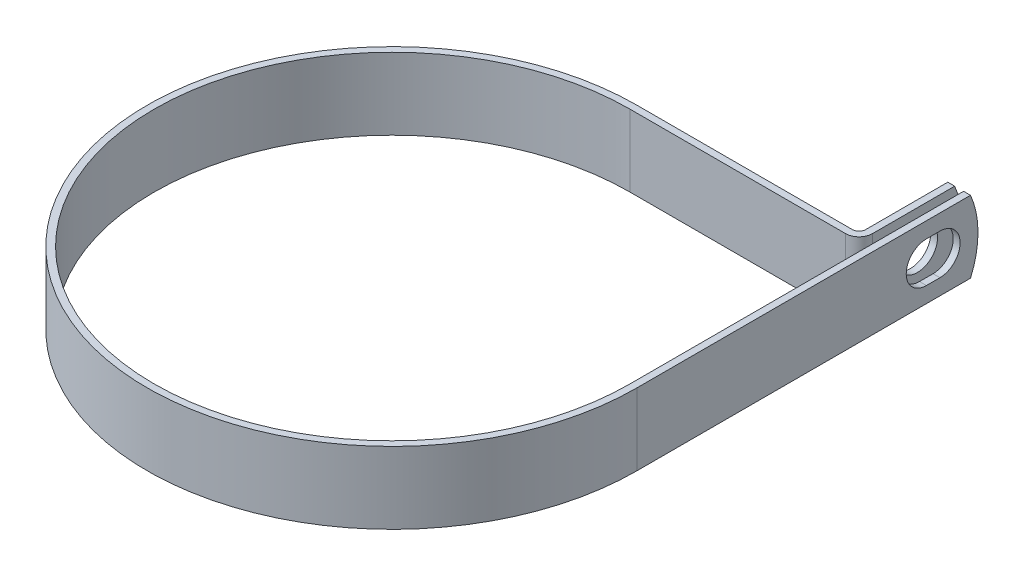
ISO-10303-21;
HEADER;
FILE_DESCRIPTION(('STEP AP214'),'2;1');
FILE_NAME('part.step','',(''),(''),'','','');
FILE_SCHEMA(('AUTOMOTIVE_DESIGN { 1 0 10303 214 1 1 1 1 }'));
ENDSEC;
DATA;
#1=APPLICATION_CONTEXT('core data for automotive mechanical design processes');
#2=APPLICATION_PROTOCOL_DEFINITION('international standard','automotive_design',2000,#1);
#3=PRODUCT_CONTEXT('',#1,'mechanical');
#4=PRODUCT('Part','Part','',(#3));
#5=PRODUCT_RELATED_PRODUCT_CATEGORY('part','',(#4));
#6=PRODUCT_DEFINITION_FORMATION('','',#4);
#7=PRODUCT_DEFINITION_CONTEXT('part definition',#1,'design');
#8=PRODUCT_DEFINITION('design','',#6,#7);
#9=PRODUCT_DEFINITION_SHAPE('','',#8);
#10=(LENGTH_UNIT() NAMED_UNIT(*) SI_UNIT(.MILLI.,.METRE.));
#11=(NAMED_UNIT(*) PLANE_ANGLE_UNIT() SI_UNIT($,.RADIAN.));
#12=(NAMED_UNIT(*) SI_UNIT($,.STERADIAN.) SOLID_ANGLE_UNIT());
#13=UNCERTAINTY_MEASURE_WITH_UNIT(LENGTH_MEASURE(1.E-05),#10,'distance_accuracy_value','');
#14=(GEOMETRIC_REPRESENTATION_CONTEXT(3) GLOBAL_UNCERTAINTY_ASSIGNED_CONTEXT((#13)) GLOBAL_UNIT_ASSIGNED_CONTEXT((#10,
#11,#12)) REPRESENTATION_CONTEXT('',''));
#15=CARTESIAN_POINT('',(0.,0.,0.));
#16=DIRECTION('',(0.,0.,1.));
#17=DIRECTION('',(1.,0.,0.));
#18=AXIS2_PLACEMENT_3D('',#15,#16,#17);
#19=CARTESIAN_POINT('',(42.0624,6.35,0.));
#20=DIRECTION('',(-1.,0.,0.));
#21=DIRECTION('',(0.,0.,1.));
#22=AXIS2_PLACEMENT_3D('',#19,#20,#21);
#23=PLANE('',#22);
#24=DIRECTION('',(0.,0.,-1.));
#25=VECTOR('',#24,1.);
#26=CARTESIAN_POINT('',(42.0624,-3.5687,-51.1809999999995));
#27=LINE('',#26,#25);
#28=CARTESIAN_POINT('',(42.0624,-3.5687,-51.1809999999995));
#29=VERTEX_POINT('',#28);
#30=CARTESIAN_POINT('',(42.0624,-3.5687,-53.5686000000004));
#31=VERTEX_POINT('',#30);
#32=EDGE_CURVE('E236',#29,#31,#27,.T.);
#33=ORIENTED_EDGE('',*,*,#32,.T.);
#34=CARTESIAN_POINT('',(42.0624,0.,-53.5685999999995));
#35=DIRECTION('',(-1.,0.,0.));
#36=DIRECTION('',(0.,0.,1.));
#37=AXIS2_PLACEMENT_3D('',#34,#35,#36);
#38=CIRCLE('',#37,3.5687);
#39=CARTESIAN_POINT('',(42.0624,3.5687,-53.5686000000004));
#40=VERTEX_POINT('',#39);
#41=EDGE_CURVE('E257',#31,#40,#38,.F.);
#42=ORIENTED_EDGE('',*,*,#41,.T.);
#43=DIRECTION('',(0.,0.,1.));
#44=VECTOR('',#43,1.);
#45=CARTESIAN_POINT('',(42.0624,3.5687,-51.1809999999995));
#46=LINE('',#45,#44);
#47=CARTESIAN_POINT('',(42.0624,3.5687,-51.1809999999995));
#48=VERTEX_POINT('',#47);
#49=EDGE_CURVE('E253',#40,#48,#46,.T.);
#50=ORIENTED_EDGE('',*,*,#49,.T.);
#51=CARTESIAN_POINT('',(42.0624,0.,-51.1809999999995));
#52=DIRECTION('',(-1.,0.,0.));
#53=DIRECTION('',(0.,0.,1.));
#54=AXIS2_PLACEMENT_3D('',#51,#52,#53);
#55=CIRCLE('',#54,3.5687);
#56=EDGE_CURVE('E248',#48,#29,#55,.F.);
#57=ORIENTED_EDGE('',*,*,#56,.T.);
#58=EDGE_LOOP('',(#33,#42,#50,#57));
#59=FACE_BOUND('',#58,.T.);
#60=CARTESIAN_POINT('',(42.0624,0.,-44.4246));
#61=DIRECTION('',(-1.,0.,0.));
#62=DIRECTION('',(0.,0.,1.));
#63=AXIS2_PLACEMENT_3D('',#60,#61,#62);
#64=CIRCLE('',#63,15.875);
#65=CARTESIAN_POINT('',(42.0624,6.35,-58.9742778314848));
#66=VERTEX_POINT('',#65);
#67=CARTESIAN_POINT('',(42.0624,-6.35,-58.9742778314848));
#68=VERTEX_POINT('',#67);
#69=EDGE_CURVE('E75',#66,#68,#64,.T.);
#70=ORIENTED_EDGE('',*,*,#69,.T.);
#71=DIRECTION('',(0.,0.,-1.));
#72=VECTOR('',#71,1.);
#73=CARTESIAN_POINT('',(42.0624,-6.35,0.));
#74=LINE('',#73,#72);
#75=CARTESIAN_POINT('',(42.0624,-6.35,0.));
#76=VERTEX_POINT('',#75);
#77=EDGE_CURVE('E271',#76,#68,#74,.T.);
#78=ORIENTED_EDGE('',*,*,#77,.F.);
#79=DIRECTION('',(0.,-1.,0.));
#80=VECTOR('',#79,1.);
#81=CARTESIAN_POINT('',(42.0624,6.35,0.));
#82=LINE('',#81,#80);
#83=CARTESIAN_POINT('',(42.0624,6.35,0.));
#84=VERTEX_POINT('',#83);
#85=EDGE_CURVE('E218',#84,#76,#82,.T.);
#86=ORIENTED_EDGE('',*,*,#85,.F.);
#87=DIRECTION('',(0.,0.,-1.));
#88=VECTOR('',#87,1.);
#89=CARTESIAN_POINT('',(42.0624,6.35,-42.0624));
#90=LINE('',#89,#88);
#91=EDGE_CURVE('E273',#84,#66,#90,.T.);
#92=ORIENTED_EDGE('',*,*,#91,.T.);
#93=EDGE_LOOP('',(#70,#78,#86,#92));
#94=FACE_BOUND('',#93,.T.);
#95=ADVANCED_FACE('F54',(#59,#94),#23,.T.);
#96=CARTESIAN_POINT('',(40.4876,6.35,-60.2996));
#97=DIRECTION('',(1.,0.,0.));
#98=DIRECTION('',(0.,0.,-1.));
#99=AXIS2_PLACEMENT_3D('',#96,#97,#98);
#100=PLANE('',#99);
#101=CARTESIAN_POINT('',(40.4876,0.,-52.3748));
#102=DIRECTION('',(1.,0.,0.));
#103=DIRECTION('',(0.,0.,-1.));
#104=AXIS2_PLACEMENT_3D('',#101,#102,#103);
#105=CIRCLE('',#104,3.5687);
#106=CARTESIAN_POINT('',(40.4876,0.,-48.8061));
#107=VERTEX_POINT('',#106);
#108=EDGE_CURVE('E268',#107,#107,#105,.F.);
#109=ORIENTED_EDGE('',*,*,#108,.T.);
#110=EDGE_LOOP('',(#109));
#111=FACE_BOUND('',#110,.T.);
#112=DIRECTION('',(0.,0.,1.));
#113=VECTOR('',#112,1.);
#114=CARTESIAN_POINT('',(40.4876,-6.35,-60.2996));
#115=LINE('',#114,#113);
#116=CARTESIAN_POINT('',(40.4876,-6.35,-58.9742778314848));
#117=VERTEX_POINT('',#116);
#118=CARTESIAN_POINT('',(40.4876,-6.35,-44.43984));
#119=VERTEX_POINT('',#118);
#120=EDGE_CURVE('E184',#117,#119,#115,.T.);
#121=ORIENTED_EDGE('',*,*,#120,.F.);
#122=CARTESIAN_POINT('',(40.4876,0.,-44.4246));
#123=DIRECTION('',(1.,0.,0.));
#124=DIRECTION('',(0.,0.,-1.));
#125=AXIS2_PLACEMENT_3D('',#122,#123,#124);
#126=CIRCLE('',#125,15.875);
#127=CARTESIAN_POINT('',(40.4876,6.35,-58.9742778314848));
#128=VERTEX_POINT('',#127);
#129=EDGE_CURVE('E176',#117,#128,#126,.T.);
#130=ORIENTED_EDGE('',*,*,#129,.T.);
#131=DIRECTION('',(0.,0.,1.));
#132=VECTOR('',#131,1.);
#133=CARTESIAN_POINT('',(40.4876,6.35,-60.2996));
#134=LINE('',#133,#132);
#135=CARTESIAN_POINT('',(40.4876,6.35,-44.43984));
#136=VERTEX_POINT('',#135);
#137=EDGE_CURVE('E224',#128,#136,#134,.T.);
#138=ORIENTED_EDGE('',*,*,#137,.T.);
#139=DIRECTION('',(0.,-1.,0.));
#140=VECTOR('',#139,1.);
#141=CARTESIAN_POINT('',(40.4876,6.35,-44.43984));
#142=LINE('',#141,#140);
#143=EDGE_CURVE('E211',#136,#119,#142,.T.);
#144=ORIENTED_EDGE('',*,*,#143,.T.);
#145=EDGE_LOOP('',(#121,#130,#138,#144));
#146=FACE_BOUND('',#145,.T.);
#147=ADVANCED_FACE('F226',(#111,#146),#100,.T.);
#148=CARTESIAN_POINT('',(39.2684,6.35,-60.2996));
#149=DIRECTION('',(1.,0.,0.));
#150=DIRECTION('',(0.,0.,-1.));
#151=AXIS2_PLACEMENT_3D('',#148,#149,#150);
#152=PLANE('',#151);
#153=CARTESIAN_POINT('',(39.2684,0.,-52.3748));
#154=DIRECTION('',(-1.,0.,0.));
#155=DIRECTION('',(0.,0.,1.));
#156=AXIS2_PLACEMENT_3D('',#153,#154,#155);
#157=CIRCLE('',#156,3.5687);
#158=CARTESIAN_POINT('',(39.2684,0.,-48.8061));
#159=VERTEX_POINT('',#158);
#160=EDGE_CURVE('E265',#159,#159,#157,.T.);
#161=ORIENTED_EDGE('',*,*,#160,.F.);
#162=EDGE_LOOP('',(#161));
#163=FACE_BOUND('',#162,.T.);
#164=CARTESIAN_POINT('',(39.2684,0.,-44.4246));
#165=DIRECTION('',(-1.,0.,0.));
#166=DIRECTION('',(0.,0.,1.));
#167=AXIS2_PLACEMENT_3D('',#164,#165,#166);
#168=CIRCLE('',#167,15.875);
#169=CARTESIAN_POINT('',(39.2684,6.35,-58.9742778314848));
#170=VERTEX_POINT('',#169);
#171=CARTESIAN_POINT('',(39.2684,-6.35,-58.9742778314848));
#172=VERTEX_POINT('',#171);
#173=EDGE_CURVE('E67',#170,#172,#168,.T.);
#174=ORIENTED_EDGE('',*,*,#173,.T.);
#175=DIRECTION('',(0.,0.,1.));
#176=VECTOR('',#175,1.);
#177=CARTESIAN_POINT('',(39.2684,-6.35,-60.2996));
#178=LINE('',#177,#176);
#179=CARTESIAN_POINT('',(39.2684,-6.35,-44.43984));
#180=VERTEX_POINT('',#179);
#181=EDGE_CURVE('E167',#172,#180,#178,.T.);
#182=ORIENTED_EDGE('',*,*,#181,.T.);
#183=DIRECTION('',(0.,-1.,0.));
#184=VECTOR('',#183,1.);
#185=CARTESIAN_POINT('',(39.2684,6.35,-44.43984));
#186=LINE('',#185,#184);
#187=CARTESIAN_POINT('',(39.2684,6.35,-44.43984));
#188=VERTEX_POINT('',#187);
#189=EDGE_CURVE('E209',#188,#180,#186,.T.);
#190=ORIENTED_EDGE('',*,*,#189,.F.);
#191=DIRECTION('',(0.,0.,1.));
#192=VECTOR('',#191,1.);
#193=CARTESIAN_POINT('',(39.2684,6.35,-60.2996));
#194=LINE('',#193,#192);
#195=EDGE_CURVE('E169',#170,#188,#194,.T.);
#196=ORIENTED_EDGE('',*,*,#195,.F.);
#197=EDGE_LOOP('',(#174,#182,#190,#196));
#198=FACE_BOUND('',#197,.T.);
#199=ADVANCED_FACE('F164',(#163,#198),#152,.F.);
#200=CARTESIAN_POINT('',(43.2816,6.35,0.));
#201=DIRECTION('',(-1.,0.,0.));
#202=DIRECTION('',(0.,0.,1.));
#203=AXIS2_PLACEMENT_3D('',#200,#201,#202);
#204=PLANE('',#203);
#205=CARTESIAN_POINT('',(43.2816,0.,-53.5685999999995));
#206=DIRECTION('',(1.,0.,0.));
#207=DIRECTION('',(0.,0.,-1.));
#208=AXIS2_PLACEMENT_3D('',#205,#206,#207);
#209=CIRCLE('',#208,3.5687);
#210=CARTESIAN_POINT('',(43.2816,-3.5687,-53.5686000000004));
#211=VERTEX_POINT('',#210);
#212=CARTESIAN_POINT('',(43.2816,3.5687,-53.5686000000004));
#213=VERTEX_POINT('',#212);
#214=EDGE_CURVE('E237',#211,#213,#209,.T.);
#215=ORIENTED_EDGE('',*,*,#214,.F.);
#216=DIRECTION('',(0.,0.,-1.));
#217=VECTOR('',#216,1.);
#218=CARTESIAN_POINT('',(43.2816,-3.5687,-51.1809999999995));
#219=LINE('',#218,#217);
#220=CARTESIAN_POINT('',(43.2816,-3.5687,-51.1809999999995));
#221=VERTEX_POINT('',#220);
#222=EDGE_CURVE('E240',#221,#211,#219,.T.);
#223=ORIENTED_EDGE('',*,*,#222,.F.);
#224=CARTESIAN_POINT('',(43.2816,0.,-51.1809999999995));
#225=DIRECTION('',(1.,0.,0.));
#226=DIRECTION('',(0.,0.,-1.));
#227=AXIS2_PLACEMENT_3D('',#224,#225,#226);
#228=CIRCLE('',#227,3.5687);
#229=CARTESIAN_POINT('',(43.2816,3.5687,-51.1809999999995));
#230=VERTEX_POINT('',#229);
#231=EDGE_CURVE('E230',#230,#221,#228,.T.);
#232=ORIENTED_EDGE('',*,*,#231,.F.);
#233=DIRECTION('',(0.,0.,1.));
#234=VECTOR('',#233,1.);
#235=CARTESIAN_POINT('',(43.2816,3.5687,-51.1809999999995));
#236=LINE('',#235,#234);
#237=EDGE_CURVE('E234',#213,#230,#236,.T.);
#238=ORIENTED_EDGE('',*,*,#237,.F.);
#239=EDGE_LOOP('',(#215,#223,#232,#238));
#240=FACE_BOUND('',#239,.T.);
#241=DIRECTION('',(0.,0.,-1.));
#242=VECTOR('',#241,1.);
#243=CARTESIAN_POINT('',(43.2816,-6.35,0.));
#244=LINE('',#243,#242);
#245=CARTESIAN_POINT('',(43.2816,-6.35,0.));
#246=VERTEX_POINT('',#245);
#247=CARTESIAN_POINT('',(43.2816,-6.35,-58.9742778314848));
#248=VERTEX_POINT('',#247);
#249=EDGE_CURVE('E195',#246,#248,#244,.T.);
#250=ORIENTED_EDGE('',*,*,#249,.T.);
#251=CARTESIAN_POINT('',(43.2816,0.,-44.4246));
#252=DIRECTION('',(-1.,0.,0.));
#253=DIRECTION('',(0.,0.,1.));
#254=AXIS2_PLACEMENT_3D('',#251,#252,#253);
#255=CIRCLE('',#254,15.875);
#256=CARTESIAN_POINT('',(43.2816,6.35,-58.9742778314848));
#257=VERTEX_POINT('',#256);
#258=EDGE_CURVE('E170',#257,#248,#255,.T.);
#259=ORIENTED_EDGE('',*,*,#258,.F.);
#260=DIRECTION('',(0.,0.,-1.));
#261=VECTOR('',#260,1.);
#262=CARTESIAN_POINT('',(43.2816,6.35,-42.0624));
#263=LINE('',#262,#261);
#264=CARTESIAN_POINT('',(43.2816,6.35,0.));
#265=VERTEX_POINT('',#264);
#266=EDGE_CURVE('E198',#265,#257,#263,.T.);
#267=ORIENTED_EDGE('',*,*,#266,.F.);
#268=DIRECTION('',(0.,-1.,0.));
#269=VECTOR('',#268,1.);
#270=CARTESIAN_POINT('',(43.2816,6.35,0.));
#271=LINE('',#270,#269);
#272=EDGE_CURVE('E199',#265,#246,#271,.T.);
#273=ORIENTED_EDGE('',*,*,#272,.T.);
#274=EDGE_LOOP('',(#250,#259,#267,#273));
#275=FACE_BOUND('',#274,.T.);
#276=ADVANCED_FACE('F321',(#240,#275),#204,.F.);
#277=CARTESIAN_POINT('',(0.,-6.35,0.));
#278=DIRECTION('',(0.,1.,0.));
#279=DIRECTION('',(1.,0.,0.));
#280=AXIS2_PLACEMENT_3D('',#277,#278,#279);
#281=PLANE('',#280);
#282=DIRECTION('',(-1.,0.,0.));
#283=VECTOR('',#282,1.);
#284=CARTESIAN_POINT('',(43.2816,-6.35,-58.9742778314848));
#285=LINE('',#284,#283);
#286=EDGE_CURVE('E171',#248,#68,#285,.T.);
#287=ORIENTED_EDGE('',*,*,#286,.F.);
#288=ORIENTED_EDGE('',*,*,#249,.F.);
#289=CARTESIAN_POINT('',(0.,-6.35,0.));
#290=DIRECTION('',(0.,1.,0.));
#291=DIRECTION('',(1.,0.,0.));
#292=AXIS2_PLACEMENT_3D('',#289,#290,#291);
#293=CIRCLE('',#292,43.2816);
#294=CARTESIAN_POINT('',(0.,-6.35,-43.2816));
#295=VERTEX_POINT('',#294);
#296=EDGE_CURVE('E193',#295,#246,#293,.T.);
#297=ORIENTED_EDGE('',*,*,#296,.F.);
#298=DIRECTION('',(1.,0.,0.));
#299=VECTOR('',#298,1.);
#300=CARTESIAN_POINT('',(0.,-6.35,-43.2816));
#301=LINE('',#300,#299);
#302=CARTESIAN_POINT('',(38.11016,-6.35,-43.2816));
#303=VERTEX_POINT('',#302);
#304=EDGE_CURVE('E186',#303,#295,#301,.F.);
#305=ORIENTED_EDGE('',*,*,#304,.F.);
#306=CARTESIAN_POINT('',(38.11016,-6.35,-44.43984));
#307=DIRECTION('',(0.,1.,0.));
#308=DIRECTION('',(1.,0.,0.));
#309=AXIS2_PLACEMENT_3D('',#306,#307,#308);
#310=CIRCLE('',#309,1.15824);
#311=EDGE_CURVE('E183',#180,#303,#310,.F.);
#312=ORIENTED_EDGE('',*,*,#311,.F.);
#313=ORIENTED_EDGE('',*,*,#181,.F.);
#314=DIRECTION('',(-1.,0.,0.));
#315=VECTOR('',#314,1.);
#316=CARTESIAN_POINT('',(43.2816,-6.35,-58.9742778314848));
#317=LINE('',#316,#315);
#318=EDGE_CURVE('E12',#117,#172,#317,.T.);
#319=ORIENTED_EDGE('',*,*,#318,.F.);
#320=ORIENTED_EDGE('',*,*,#120,.T.);
#321=CARTESIAN_POINT('',(38.11016,-6.35,-44.43984));
#322=DIRECTION('',(0.,-1.,0.));
#323=DIRECTION('',(0.,0.,1.));
#324=AXIS2_PLACEMENT_3D('',#321,#322,#323);
#325=CIRCLE('',#324,2.37744);
#326=CARTESIAN_POINT('',(38.11016,-6.35,-42.0624));
#327=VERTEX_POINT('',#326);
#328=EDGE_CURVE('E188',#119,#327,#325,.T.);
#329=ORIENTED_EDGE('',*,*,#328,.T.);
#330=DIRECTION('',(-1.,0.,0.));
#331=VECTOR('',#330,1.);
#332=CARTESIAN_POINT('',(0.,-6.35,-42.0624));
#333=LINE('',#332,#331);
#334=CARTESIAN_POINT('',(0.,-6.35,-42.0624));
#335=VERTEX_POINT('',#334);
#336=EDGE_CURVE('E298',#327,#335,#333,.T.);
#337=ORIENTED_EDGE('',*,*,#336,.T.);
#338=CARTESIAN_POINT('',(0.,-6.35,0.));
#339=DIRECTION('',(0.,1.,0.));
#340=DIRECTION('',(0.,0.,1.));
#341=AXIS2_PLACEMENT_3D('',#338,#339,#340);
#342=CIRCLE('',#341,42.0624);
#343=EDGE_CURVE('E295',#335,#76,#342,.T.);
#344=ORIENTED_EDGE('',*,*,#343,.T.);
#345=ORIENTED_EDGE('',*,*,#77,.T.);
#346=EDGE_LOOP('',(#287,#288,#297,#305,#312,#313,#319,#320,#329,#337,#344,#345));
#347=FACE_BOUND('',#346,.T.);
#348=ADVANCED_FACE('F181',(#347),#281,.F.);
#349=CARTESIAN_POINT('',(0.,6.35,0.));
#350=DIRECTION('',(0.,1.,0.));
#351=DIRECTION('',(1.,0.,0.));
#352=AXIS2_PLACEMENT_3D('',#349,#350,#351);
#353=PLANE('',#352);
#354=ORIENTED_EDGE('',*,*,#266,.T.);
#355=DIRECTION('',(-1.,0.,0.));
#356=VECTOR('',#355,1.);
#357=CARTESIAN_POINT('',(43.2816,6.35,-58.9742778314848));
#358=LINE('',#357,#356);
#359=EDGE_CURVE('E228',#257,#66,#358,.T.);
#360=ORIENTED_EDGE('',*,*,#359,.T.);
#361=ORIENTED_EDGE('',*,*,#91,.F.);
#362=CARTESIAN_POINT('',(0.,6.35,0.));
#363=DIRECTION('',(0.,1.,0.));
#364=DIRECTION('',(0.,0.,1.));
#365=AXIS2_PLACEMENT_3D('',#362,#363,#364);
#366=CIRCLE('',#365,42.0624);
#367=CARTESIAN_POINT('',(0.,6.35,-42.0624));
#368=VERTEX_POINT('',#367);
#369=EDGE_CURVE('E276',#368,#84,#366,.T.);
#370=ORIENTED_EDGE('',*,*,#369,.F.);
#371=DIRECTION('',(-1.,0.,0.));
#372=VECTOR('',#371,1.);
#373=CARTESIAN_POINT('',(0.,6.35,-42.0624));
#374=LINE('',#373,#372);
#375=CARTESIAN_POINT('',(38.11016,6.35,-42.0624));
#376=VERTEX_POINT('',#375);
#377=EDGE_CURVE('E279',#376,#368,#374,.T.);
#378=ORIENTED_EDGE('',*,*,#377,.F.);
#379=CARTESIAN_POINT('',(38.11016,6.35,-44.43984));
#380=DIRECTION('',(0.,-1.,0.));
#381=DIRECTION('',(0.,0.,1.));
#382=AXIS2_PLACEMENT_3D('',#379,#380,#381);
#383=CIRCLE('',#382,2.37744);
#384=EDGE_CURVE('E282',#136,#376,#383,.T.);
#385=ORIENTED_EDGE('',*,*,#384,.F.);
#386=ORIENTED_EDGE('',*,*,#137,.F.);
#387=DIRECTION('',(-1.,0.,0.));
#388=VECTOR('',#387,1.);
#389=CARTESIAN_POINT('',(43.2816,6.35,-58.9742778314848));
#390=LINE('',#389,#388);
#391=EDGE_CURVE('E61',#128,#170,#390,.T.);
#392=ORIENTED_EDGE('',*,*,#391,.T.);
#393=ORIENTED_EDGE('',*,*,#195,.T.);
#394=CARTESIAN_POINT('',(38.11016,6.35,-44.43984));
#395=DIRECTION('',(0.,1.,0.));
#396=DIRECTION('',(1.,0.,0.));
#397=AXIS2_PLACEMENT_3D('',#394,#395,#396);
#398=CIRCLE('',#397,1.15824);
#399=CARTESIAN_POINT('',(38.11016,6.35,-43.2816));
#400=VERTEX_POINT('',#399);
#401=EDGE_CURVE('E287',#188,#400,#398,.F.);
#402=ORIENTED_EDGE('',*,*,#401,.T.);
#403=DIRECTION('',(1.,0.,0.));
#404=VECTOR('',#403,1.);
#405=CARTESIAN_POINT('',(0.,6.35,-43.2816));
#406=LINE('',#405,#404);
#407=CARTESIAN_POINT('',(0.,6.35,-43.2816));
#408=VERTEX_POINT('',#407);
#409=EDGE_CURVE('E289',#400,#408,#406,.F.);
#410=ORIENTED_EDGE('',*,*,#409,.T.);
#411=CARTESIAN_POINT('',(0.,6.35,0.));
#412=DIRECTION('',(0.,1.,0.));
#413=DIRECTION('',(1.,0.,0.));
#414=AXIS2_PLACEMENT_3D('',#411,#412,#413);
#415=CIRCLE('',#414,43.2816);
#416=EDGE_CURVE('E203',#408,#265,#415,.T.);
#417=ORIENTED_EDGE('',*,*,#416,.T.);
#418=EDGE_LOOP('',(#354,#360,#361,#370,#378,#385,#386,#392,#393,#402,#410,#417));
#419=FACE_BOUND('',#418,.T.);
#420=ADVANCED_FACE('F222',(#419),#353,.T.);
#421=CARTESIAN_POINT('',(0.,6.35,0.));
#422=DIRECTION('',(0.,-1.,0.));
#423=DIRECTION('',(0.,0.,-1.));
#424=AXIS2_PLACEMENT_3D('',#421,#422,#423);
#425=CYLINDRICAL_SURFACE('',#424,42.0624);
#426=ORIENTED_EDGE('',*,*,#343,.F.);
#427=DIRECTION('',(0.,-1.,0.));
#428=VECTOR('',#427,1.);
#429=CARTESIAN_POINT('',(0.,6.35,-42.0624));
#430=LINE('',#429,#428);
#431=EDGE_CURVE('E216',#368,#335,#430,.T.);
#432=ORIENTED_EDGE('',*,*,#431,.F.);
#433=ORIENTED_EDGE('',*,*,#369,.T.);
#434=ORIENTED_EDGE('',*,*,#85,.T.);
#435=EDGE_LOOP('',(#426,#432,#433,#434));
#436=FACE_BOUND('',#435,.T.);
#437=ADVANCED_FACE('F311',(#436),#425,.F.);
#438=CARTESIAN_POINT('',(0.,6.35,-42.0624));
#439=DIRECTION('',(0.,0.,1.));
#440=DIRECTION('',(1.,0.,0.));
#441=AXIS2_PLACEMENT_3D('',#438,#439,#440);
#442=PLANE('',#441);
#443=ORIENTED_EDGE('',*,*,#336,.F.);
#444=DIRECTION('',(0.,-1.,0.));
#445=VECTOR('',#444,1.);
#446=CARTESIAN_POINT('',(38.11016,6.35,-42.0624));
#447=LINE('',#446,#445);
#448=EDGE_CURVE('E214',#376,#327,#447,.T.);
#449=ORIENTED_EDGE('',*,*,#448,.F.);
#450=ORIENTED_EDGE('',*,*,#377,.T.);
#451=ORIENTED_EDGE('',*,*,#431,.T.);
#452=EDGE_LOOP('',(#443,#449,#450,#451));
#453=FACE_BOUND('',#452,.T.);
#454=ADVANCED_FACE('F307',(#453),#442,.T.);
#455=CARTESIAN_POINT('',(38.11016,6.35,-44.43984));
#456=DIRECTION('',(0.,-1.,0.));
#457=DIRECTION('',(0.,0.,-1.));
#458=AXIS2_PLACEMENT_3D('',#455,#456,#457);
#459=CYLINDRICAL_SURFACE('',#458,2.37744);
#460=ORIENTED_EDGE('',*,*,#328,.F.);
#461=ORIENTED_EDGE('',*,*,#143,.F.);
#462=ORIENTED_EDGE('',*,*,#384,.T.);
#463=ORIENTED_EDGE('',*,*,#448,.T.);
#464=EDGE_LOOP('',(#460,#461,#462,#463));
#465=FACE_BOUND('',#464,.T.);
#466=ADVANCED_FACE('F304',(#465),#459,.T.);
#467=CARTESIAN_POINT('',(38.11016,6.35,-44.43984));
#468=DIRECTION('',(0.,-1.,0.));
#469=DIRECTION('',(0.,0.,-1.));
#470=AXIS2_PLACEMENT_3D('',#467,#468,#469);
#471=CYLINDRICAL_SURFACE('',#470,1.15824);
#472=ORIENTED_EDGE('',*,*,#311,.T.);
#473=DIRECTION('',(0.,-1.,0.));
#474=VECTOR('',#473,1.);
#475=CARTESIAN_POINT('',(38.11016,6.35,-43.2816));
#476=LINE('',#475,#474);
#477=EDGE_CURVE('E206',#400,#303,#476,.T.);
#478=ORIENTED_EDGE('',*,*,#477,.F.);
#479=ORIENTED_EDGE('',*,*,#401,.F.);
#480=ORIENTED_EDGE('',*,*,#189,.T.);
#481=EDGE_LOOP('',(#472,#478,#479,#480));
#482=FACE_BOUND('',#481,.T.);
#483=ADVANCED_FACE('F334',(#482),#471,.F.);
#484=CARTESIAN_POINT('',(0.,6.35,-43.2816));
#485=DIRECTION('',(0.,0.,1.));
#486=DIRECTION('',(1.,0.,0.));
#487=AXIS2_PLACEMENT_3D('',#484,#485,#486);
#488=PLANE('',#487);
#489=ORIENTED_EDGE('',*,*,#304,.T.);
#490=DIRECTION('',(0.,-1.,0.));
#491=VECTOR('',#490,1.);
#492=CARTESIAN_POINT('',(0.,6.35,-43.2816));
#493=LINE('',#492,#491);
#494=EDGE_CURVE('E202',#408,#295,#493,.T.);
#495=ORIENTED_EDGE('',*,*,#494,.F.);
#496=ORIENTED_EDGE('',*,*,#409,.F.);
#497=ORIENTED_EDGE('',*,*,#477,.T.);
#498=EDGE_LOOP('',(#489,#495,#496,#497));
#499=FACE_BOUND('',#498,.T.);
#500=ADVANCED_FACE('F330',(#499),#488,.F.);
#501=CARTESIAN_POINT('',(0.,6.35,0.));
#502=DIRECTION('',(0.,-1.,0.));
#503=DIRECTION('',(0.,0.,-1.));
#504=AXIS2_PLACEMENT_3D('',#501,#502,#503);
#505=CYLINDRICAL_SURFACE('',#504,43.2816);
#506=ORIENTED_EDGE('',*,*,#296,.T.);
#507=ORIENTED_EDGE('',*,*,#272,.F.);
#508=ORIENTED_EDGE('',*,*,#416,.F.);
#509=ORIENTED_EDGE('',*,*,#494,.T.);
#510=EDGE_LOOP('',(#506,#507,#508,#509));
#511=FACE_BOUND('',#510,.T.);
#512=ADVANCED_FACE('F327',(#511),#505,.T.);
#513=CARTESIAN_POINT('',(50.5814078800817,0.,-52.3748));
#514=DIRECTION('',(-1.,0.,0.));
#515=DIRECTION('',(0.,0.,1.));
#516=AXIS2_PLACEMENT_3D('',#513,#514,#515);
#517=CYLINDRICAL_SURFACE('',#516,3.5687);
#518=CARTESIAN_POINT('',(39.2684,0.,-48.8061));
#519=CARTESIAN_POINT('',(39.2811,0.,-48.8061));
#520=CARTESIAN_POINT('',(39.2938,0.,-48.8061));
#521=CARTESIAN_POINT('',(39.3192,0.,-48.8061));
#522=CARTESIAN_POINT('',(39.3319,0.,-48.8061));
#523=CARTESIAN_POINT('',(39.3573,0.,-48.8061));
#524=CARTESIAN_POINT('',(39.37,0.,-48.8061));
#525=CARTESIAN_POINT('',(39.3954,0.,-48.8061));
#526=CARTESIAN_POINT('',(39.4081,0.,-48.8061));
#527=CARTESIAN_POINT('',(39.4335,0.,-48.8061));
#528=CARTESIAN_POINT('',(39.4462,0.,-48.8061));
#529=CARTESIAN_POINT('',(39.4716,0.,-48.8061));
#530=CARTESIAN_POINT('',(39.4843,0.,-48.8061));
#531=CARTESIAN_POINT('',(39.5097,0.,-48.8061));
#532=CARTESIAN_POINT('',(39.5224,0.,-48.8061));
#533=CARTESIAN_POINT('',(39.5478,0.,-48.8061));
#534=CARTESIAN_POINT('',(39.5605,0.,-48.8061));
#535=CARTESIAN_POINT('',(39.5859,0.,-48.8061));
#536=CARTESIAN_POINT('',(39.5986,0.,-48.8061));
#537=CARTESIAN_POINT('',(39.624,0.,-48.8061));
#538=CARTESIAN_POINT('',(39.6367,0.,-48.8061));
#539=CARTESIAN_POINT('',(39.6621,0.,-48.8061));
#540=CARTESIAN_POINT('',(39.6748,0.,-48.8061));
#541=CARTESIAN_POINT('',(39.7002,0.,-48.8061));
#542=CARTESIAN_POINT('',(39.7129,0.,-48.8061));
#543=CARTESIAN_POINT('',(39.7383,0.,-48.8061));
#544=CARTESIAN_POINT('',(39.751,0.,-48.8061));
#545=CARTESIAN_POINT('',(39.7764,0.,-48.8061));
#546=CARTESIAN_POINT('',(39.7891,0.,-48.8061));
#547=CARTESIAN_POINT('',(39.8145,0.,-48.8061));
#548=CARTESIAN_POINT('',(39.8272,0.,-48.8061));
#549=CARTESIAN_POINT('',(39.8526,0.,-48.8061));
#550=CARTESIAN_POINT('',(39.8653,0.,-48.8061));
#551=CARTESIAN_POINT('',(39.8907,0.,-48.8061));
#552=CARTESIAN_POINT('',(39.9034,0.,-48.8061));
#553=CARTESIAN_POINT('',(39.9288,0.,-48.8061));
#554=CARTESIAN_POINT('',(39.9415,0.,-48.8061));
#555=CARTESIAN_POINT('',(39.9669,0.,-48.8061));
#556=CARTESIAN_POINT('',(39.9796,0.,-48.8061));
#557=CARTESIAN_POINT('',(40.005,0.,-48.8061));
#558=CARTESIAN_POINT('',(40.0177,0.,-48.8061));
#559=CARTESIAN_POINT('',(40.0431,0.,-48.8061));
#560=CARTESIAN_POINT('',(40.0558,0.,-48.8061));
#561=CARTESIAN_POINT('',(40.0812,0.,-48.8061));
#562=CARTESIAN_POINT('',(40.0939,0.,-48.8061));
#563=CARTESIAN_POINT('',(40.1193,0.,-48.8061));
#564=CARTESIAN_POINT('',(40.132,0.,-48.8061));
#565=CARTESIAN_POINT('',(40.1574,0.,-48.8061));
#566=CARTESIAN_POINT('',(40.1701,0.,-48.8061));
#567=CARTESIAN_POINT('',(40.1955,0.,-48.8061));
#568=CARTESIAN_POINT('',(40.2082,0.,-48.8061));
#569=CARTESIAN_POINT('',(40.2336,0.,-48.8061));
#570=CARTESIAN_POINT('',(40.2463,0.,-48.8061));
#571=CARTESIAN_POINT('',(40.2717,0.,-48.8061));
#572=CARTESIAN_POINT('',(40.2844,0.,-48.8061));
#573=CARTESIAN_POINT('',(40.3098,0.,-48.8061));
#574=CARTESIAN_POINT('',(40.3225,0.,-48.8061));
#575=CARTESIAN_POINT('',(40.3479,0.,-48.8061));
#576=CARTESIAN_POINT('',(40.3606,0.,-48.8061));
#577=CARTESIAN_POINT('',(40.386,0.,-48.8061));
#578=CARTESIAN_POINT('',(40.3987,0.,-48.8061));
#579=CARTESIAN_POINT('',(40.4241,0.,-48.8061));
#580=CARTESIAN_POINT('',(40.4368,0.,-48.8061));
#581=CARTESIAN_POINT('',(40.4622,0.,-48.8061));
#582=CARTESIAN_POINT('',(40.4749,0.,-48.8061));
#583=CARTESIAN_POINT('',(40.4876,0.,-48.8061));
#584=B_SPLINE_CURVE_WITH_KNOTS('',3,(#518,#519,#520,#521,#522,#523,#524,#525,#526,#527,#528,
#529,#530,#531,#532,#533,#534,#535,#536,#537,#538,#539,#540,#541,#542,#543,#544,#545,#546,#547,
#548,#549,#550,#551,#552,#553,#554,#555,#556,#557,#558,#559,#560,#561,#562,#563,#564,#565,#566,
#567,#568,#569,#570,#571,#572,#573,#574,#575,#576,#577,#578,#579,#580,#581,#582,#583),
.UNSPECIFIED.,.F.,.F.,(4,2,2,2,2,2,2,2,2,2,2,2,2,2,2,2,2,2,2,2,2,2,2,2,2,2,2,2,2,2,2,2,4),(0.,
0.0381000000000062,0.0762000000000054,0.114300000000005,0.152400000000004,0.190500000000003,
0.228600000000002,0.266700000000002,0.304800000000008,0.342900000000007,0.381000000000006,
0.419100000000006,0.457200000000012,0.495300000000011,0.53340000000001,0.571500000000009,
0.609600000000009,0.647700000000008,0.685800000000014,0.723900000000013,0.762000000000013,
0.800100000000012,0.838200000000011,0.876300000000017,0.914400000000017,0.952500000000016,
0.990600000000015,1.02870000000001,1.06680000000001,1.10490000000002,1.14300000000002,
1.18110000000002,1.21920000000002),.UNSPECIFIED.);
#585=EDGE_CURVE('BSEAM379',#159,#107,#584,.T.);
#586=ORIENTED_EDGE('',*,*,#160,.T.);
#587=ORIENTED_EDGE('',*,*,#108,.F.);
#588=ORIENTED_EDGE('',*,*,#585,.T.);
#589=ORIENTED_EDGE('',*,*,#585,.F.);
#590=EDGE_LOOP('',(#586,#588,#587,#589));
#591=FACE_BOUND('',#590,.T.);
#592=ADVANCED_FACE('F379',(#591),#517,.F.);
#593=CARTESIAN_POINT('',(30.1599589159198,-3.5687,-51.1809999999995));
#594=DIRECTION('',(0.,-1.,0.));
#595=DIRECTION('',(0.,0.,-1.));
#596=AXIS2_PLACEMENT_3D('',#593,#594,#595);
#597=PLANE('',#596);
#598=DIRECTION('',(1.,0.,0.));
#599=VECTOR('',#598,1.);
#600=CARTESIAN_POINT('',(30.1599589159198,-3.5687,-51.1809999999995));
#601=LINE('',#600,#599);
#602=EDGE_CURVE('E251',#29,#221,#601,.T.);
#603=ORIENTED_EDGE('',*,*,#602,.T.);
#604=ORIENTED_EDGE('',*,*,#222,.T.);
#605=DIRECTION('',(1.,0.,0.));
#606=VECTOR('',#605,1.);
#607=CARTESIAN_POINT('',(30.1599589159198,-3.5687,-53.5686000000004));
#608=LINE('',#607,#606);
#609=EDGE_CURVE('E247',#31,#211,#608,.T.);
#610=ORIENTED_EDGE('',*,*,#609,.F.);
#611=ORIENTED_EDGE('',*,*,#32,.F.);
#612=EDGE_LOOP('',(#603,#604,#610,#611));
#613=FACE_BOUND('',#612,.T.);
#614=ADVANCED_FACE('F354',(#613),#597,.F.);
#615=CARTESIAN_POINT('',(30.1599589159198,0.,-53.5685999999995));
#616=DIRECTION('',(1.,0.,0.));
#617=DIRECTION('',(0.,0.,-1.));
#618=AXIS2_PLACEMENT_3D('',#615,#616,#617);
#619=CYLINDRICAL_SURFACE('',#618,3.5687);
#620=ORIENTED_EDGE('',*,*,#609,.T.);
#621=ORIENTED_EDGE('',*,*,#214,.T.);
#622=DIRECTION('',(1.,0.,0.));
#623=VECTOR('',#622,1.);
#624=CARTESIAN_POINT('',(30.1599589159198,3.5687,-53.5686000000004));
#625=LINE('',#624,#623);
#626=EDGE_CURVE('E256',#40,#213,#625,.T.);
#627=ORIENTED_EDGE('',*,*,#626,.F.);
#628=ORIENTED_EDGE('',*,*,#41,.F.);
#629=EDGE_LOOP('',(#620,#621,#627,#628));
#630=FACE_BOUND('',#629,.T.);
#631=ADVANCED_FACE('F358',(#630),#619,.F.);
#632=CARTESIAN_POINT('',(30.1599589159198,3.5687,-51.1809999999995));
#633=DIRECTION('',(0.,1.,0.));
#634=DIRECTION('',(0.,0.,1.));
#635=AXIS2_PLACEMENT_3D('',#632,#633,#634);
#636=PLANE('',#635);
#637=ORIENTED_EDGE('',*,*,#626,.T.);
#638=ORIENTED_EDGE('',*,*,#237,.T.);
#639=DIRECTION('',(1.,0.,0.));
#640=VECTOR('',#639,1.);
#641=CARTESIAN_POINT('',(30.1599589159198,3.5687,-51.1809999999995));
#642=LINE('',#641,#640);
#643=EDGE_CURVE('E252',#48,#230,#642,.T.);
#644=ORIENTED_EDGE('',*,*,#643,.F.);
#645=ORIENTED_EDGE('',*,*,#49,.F.);
#646=EDGE_LOOP('',(#637,#638,#644,#645));
#647=FACE_BOUND('',#646,.T.);
#648=ADVANCED_FACE('F362',(#647),#636,.F.);
#649=CARTESIAN_POINT('',(30.1599589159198,0.,-51.1809999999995));
#650=DIRECTION('',(1.,0.,0.));
#651=DIRECTION('',(0.,0.,-1.));
#652=AXIS2_PLACEMENT_3D('',#649,#650,#651);
#653=CYLINDRICAL_SURFACE('',#652,3.5687);
#654=ORIENTED_EDGE('',*,*,#643,.T.);
#655=ORIENTED_EDGE('',*,*,#231,.T.);
#656=ORIENTED_EDGE('',*,*,#602,.F.);
#657=ORIENTED_EDGE('',*,*,#56,.F.);
#658=EDGE_LOOP('',(#654,#655,#656,#657));
#659=FACE_BOUND('',#658,.T.);
#660=ADVANCED_FACE('F366',(#659),#653,.F.);
#661=CARTESIAN_POINT('',(43.2816,0.,-44.4246));
#662=DIRECTION('',(-1.,0.,0.));
#663=DIRECTION('',(0.,0.,1.));
#664=AXIS2_PLACEMENT_3D('',#661,#662,#663);
#665=CYLINDRICAL_SURFACE('',#664,15.875);
#666=ORIENTED_EDGE('',*,*,#129,.F.);
#667=ORIENTED_EDGE('',*,*,#318,.T.);
#668=ORIENTED_EDGE('',*,*,#173,.F.);
#669=ORIENTED_EDGE('',*,*,#391,.F.);
#670=EDGE_LOOP('',(#666,#667,#668,#669));
#671=FACE_BOUND('',#670,.T.);
#672=ADVANCED_FACE('F174',(#671),#665,.T.);
#673=ORIENTED_EDGE('',*,*,#359,.F.);
#674=ORIENTED_EDGE('',*,*,#258,.T.);
#675=ORIENTED_EDGE('',*,*,#286,.T.);
#676=ORIENTED_EDGE('',*,*,#69,.F.);
#677=EDGE_LOOP('',(#673,#674,#675,#676));
#678=FACE_BOUND('',#677,.T.);
#679=ADVANCED_FACE('F316',(#678),#665,.T.);
#680=CLOSED_SHELL('',(#95,#147,#199,#276,#348,#420,#437,#454,#466,#483,#500,#512,#592,#614,#631,
#648,#660,#672,#679));
#681=MANIFOLD_SOLID_BREP('B2',#680);
#682=ADVANCED_BREP_SHAPE_REPRESENTATION('',(#18,#681),#14);
#683=SHAPE_DEFINITION_REPRESENTATION(#9,#682);
ENDSEC;
END-ISO-10303-21;
